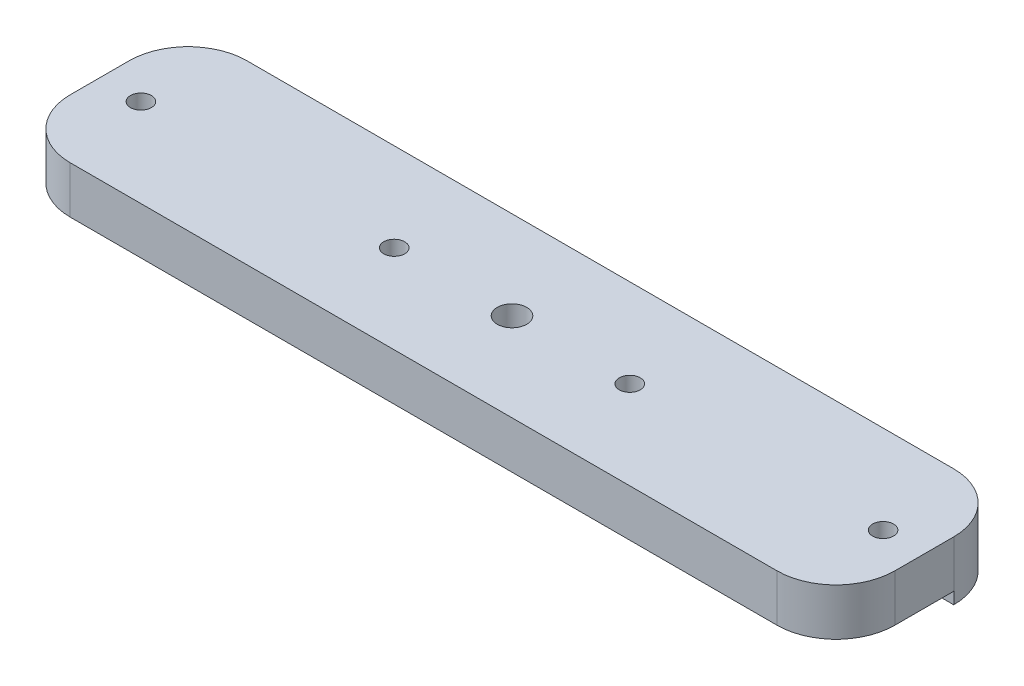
from build123d import *

# Parameters (mm, degrees)
SKETCH1_W                 = 88.9
SKETCH1_H                 = 19.05
EXTRUDE1_DEPTH            = 6.35
F_4_40_TAPPED_HOLE2_D     = 2.2606
F_4_40_TAPPED_HOLE2_DEPTH = 7.62
F_4_40_TAPPED_HOLE2_TIP   = 0.679152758
FILLET1_R                 = 6.35
EXTRUDE3_START            = -1.27
EXTRUDE3_DEPTH            = 1.27
F_4_CLEARANCE_HOLE1_D     = 3.175
F_4_CLEARANCE_HOLE1_DEPTH = 9.398
F_4_CLEARANCE_HOLE1_TIP   = 0.953866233


with BuildPart() as part:
    # Sketch1 → Extrude1 (new body)
    with BuildSketch(Plane(origin=(0, 0, 0), x_dir=(1, 0, 0), z_dir=(0, 1, 0))):
        Rectangle(SKETCH1_W, SKETCH1_H)
    extrude(amount=EXTRUDE1_DEPTH)

    # 4-40 Tapped Hole2
    with Locations(Plane(origin=(-40.005, 6.35, 0), x_dir=(0, 0, 1), z_dir=(0, 1, 0))):
        with Locations((0, 0), (0, 80.01), (0, 27.305), (0, 52.705)):
            Hole(F_4_40_TAPPED_HOLE2_D / 2, depth=F_4_40_TAPPED_HOLE2_DEPTH)
            with Locations((0, 0, -(F_4_40_TAPPED_HOLE2_DEPTH + F_4_40_TAPPED_HOLE2_TIP / 2))):  # 118° drill point
                Cone(0, F_4_40_TAPPED_HOLE2_D / 2, F_4_40_TAPPED_HOLE2_TIP, mode=Mode.SUBTRACT)

    # Fillet1
    fillet1_edges = [part.edges().sort_by_distance(p)[0] for p in [
        (44.45, 3.175, 9.525),
        (-44.45, 3.175, 9.525),
        (-44.45, 3.175, -9.525),
        (44.45, 3.175, -9.525),
    ]]
    fillet(fillet1_edges, radius=FILLET1_R)

    # Sketch8 → Extrude3 (cut)
    with BuildSketch(Plane.XZ.offset(EXTRUDE3_START)):
        with BuildLine():
            Line((-44.45, -3.175), (44.45, -3.175))
            Line((44.45, -3.175), (44.45, 3.175))
            ThreePointArc((44.45, 3.175), (42.590128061, 7.665128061), (38.1, 9.525))
            Line((38.1, 9.525), (-38.1, 9.525))
            ThreePointArc((-38.1, 9.525), (-42.590128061, 7.665128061), (-44.45, 3.175))
            Line((-44.45, 3.175), (-44.45, -3.175))
        make_face()
    extrude(amount=EXTRUDE3_DEPTH, mode=Mode.SUBTRACT)

    # 4 Clearance Hole1
    with Locations(Plane(origin=(0, 6.35, 0), x_dir=(-1, 0, 0), z_dir=(0, 1, 0))):
        with Locations((0, 0)):
            Hole(F_4_CLEARANCE_HOLE1_D / 2, depth=F_4_CLEARANCE_HOLE1_DEPTH)
            with Locations((0, 0, -(F_4_CLEARANCE_HOLE1_DEPTH + F_4_CLEARANCE_HOLE1_TIP / 2))):  # 118° drill point
                Cone(0, F_4_CLEARANCE_HOLE1_D / 2, F_4_CLEARANCE_HOLE1_TIP, mode=Mode.SUBTRACT)


solid = part.part
